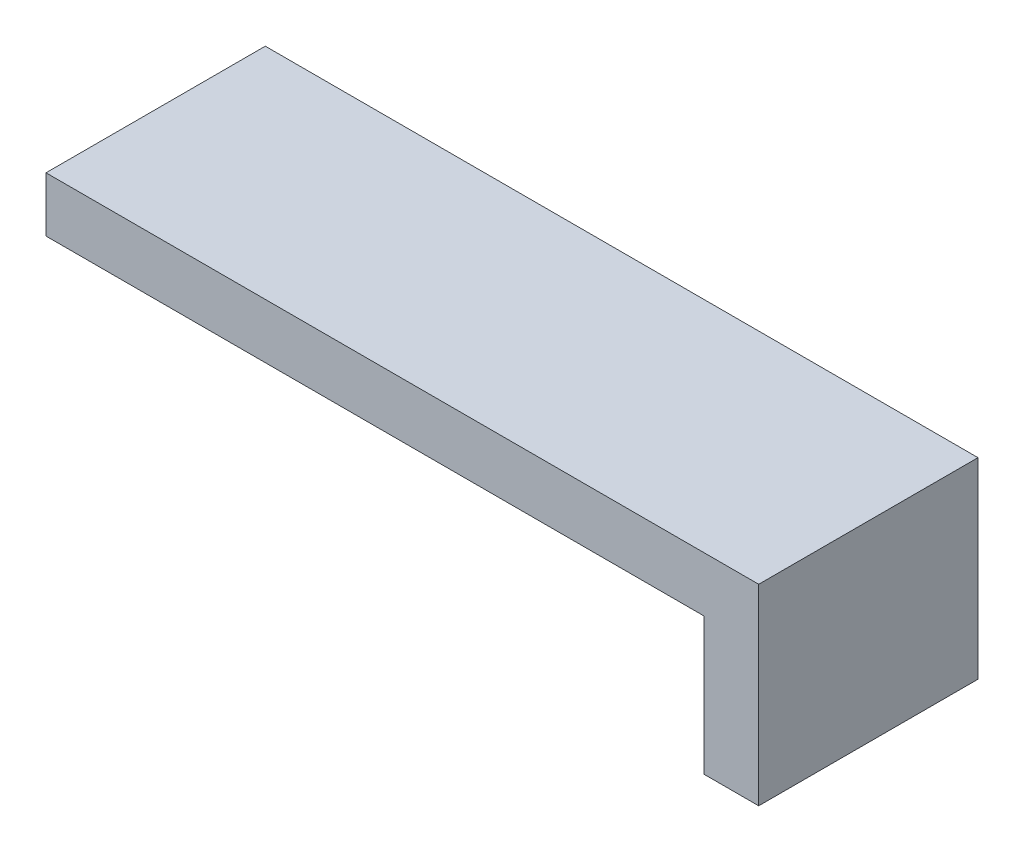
from build123d import *

# Parameters (mm, degrees)
SALIENTE_EXTRUIR1_DEPTH = 20


with BuildPart() as part:
    # Croquis2 → Saliente-Extruir1 (new, symmetric)
    with BuildSketch(Plane.XY):
        Polygon((60, 5), (-60, 5), (-60, -5), (60, -5), (60, -30), (70, -30), (70, 5), align=None)
    extrude(amount=SALIENTE_EXTRUIR1_DEPTH, both=True)


solid = part.part
